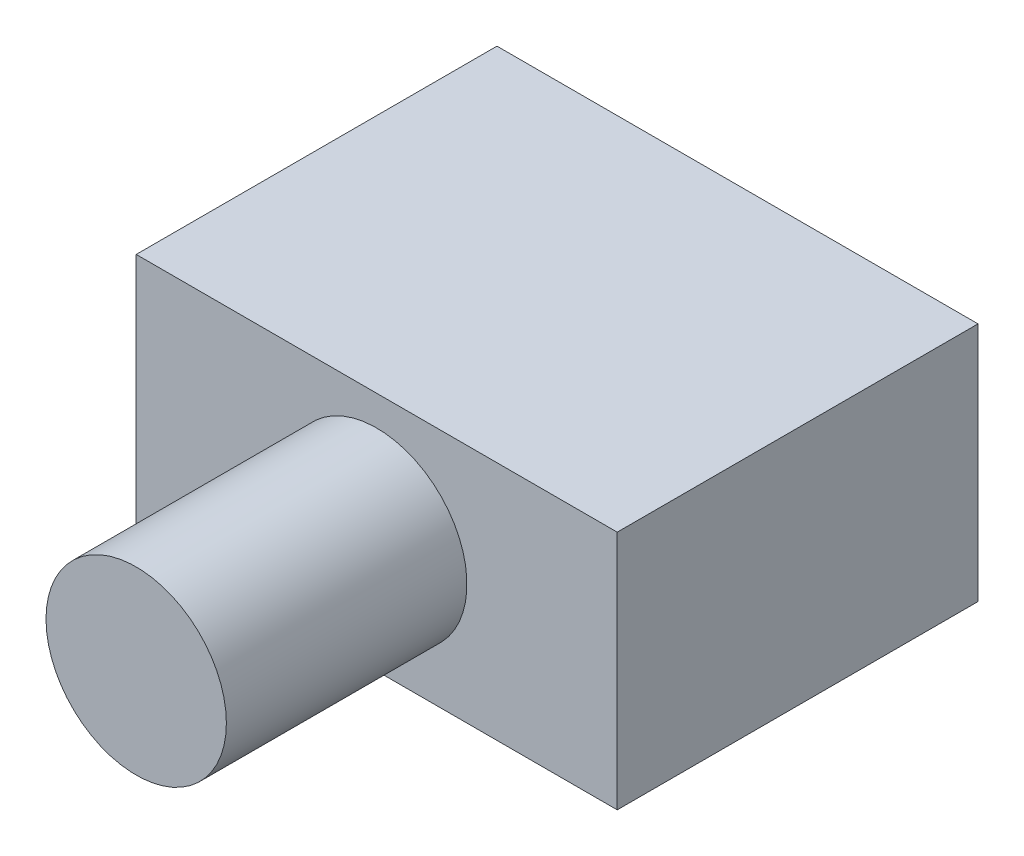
from build123d import *

# Parameters (mm, degrees)
SKETCH1_R           = 9.525
BASE_EXTRUDE_DEPTH  = 12.7
SKETCH2_W           = 50.8
SKETCH2_H           = 25.4
BOSS_EXTRUDE1_DEPTH = 38.1


with BuildPart() as part:
    # Sketch1 → Base-Extrude (new, symmetric)
    with BuildSketch(Plane.XY):
        Circle(SKETCH1_R)
    extrude(amount=BASE_EXTRUDE_DEPTH, both=True)

    # Sketch2 → Boss-Extrude1 (add)
    with BuildSketch(Plane(origin=(0, 0, -12.7), x_dir=(-1, 0, 0), z_dir=(0, 0, -1))):
        Rectangle(SKETCH2_W, SKETCH2_H)
    extrude(amount=BOSS_EXTRUDE1_DEPTH)


solid = part.part
